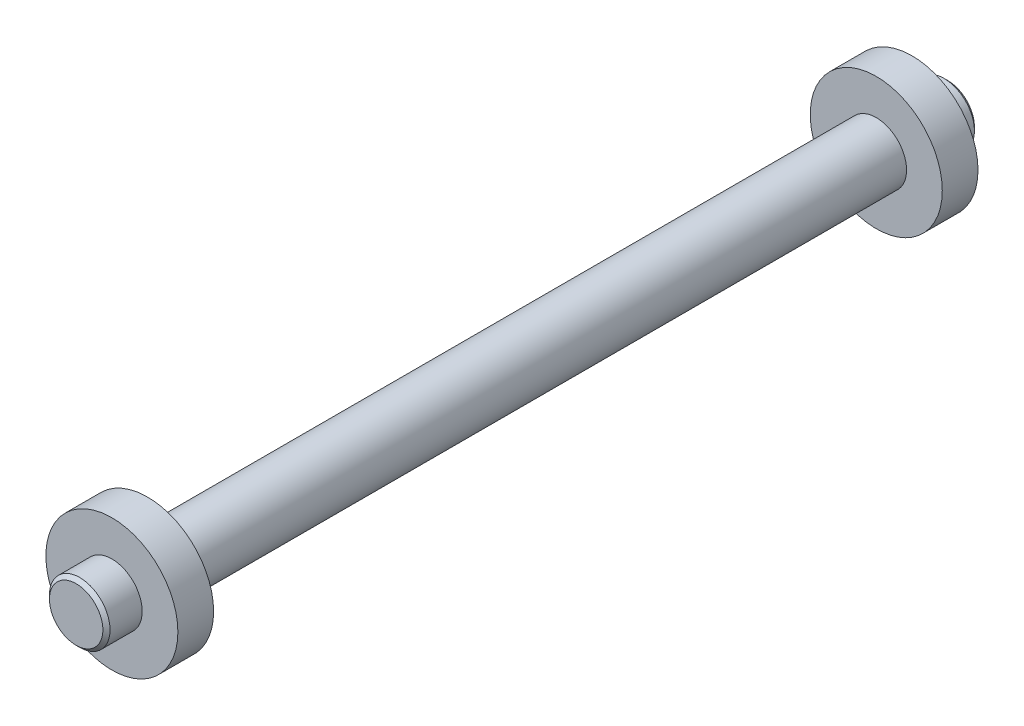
from build123d import *

# Parameters (mm, degrees)
CHAMFER_1_SIZE = 0.125


with BuildPart() as part:
    # Sketch 2 → Revolve 1 (revolve)
    with BuildSketch(Plane(origin=(0, 0, 0), x_dir=(0, 0, -1), z_dir=(1, 0, 0)), mode=Mode.PRIVATE) as revolve_1_sk:
        Polygon((-15.25, 0), (15.25, 0), (15.25, 1.06), (14, 1.06), (14, 2.31), (12.75, 2.31), (12.75, 1.06), (-12.75, 1.06), (-12.75, 2.31), (-14, 2.31), (-14, 1.06), (-15.25, 1.06), align=None)
    revolve(revolve_1_sk.sketch.rotate(Axis((0, 0, 15.25), (0, 0, -1)), 90), axis=Axis((0, 0, 15.25), (0, 0, -1)))

    # Chamfer 1
    chamfer_1_edges = [part.edges().sort_by_distance(p)[0] for p in [
        (-1.06, 0, -15.25),
        (-1.06, 0, 15.25),
    ]]
    chamfer(chamfer_1_edges, length=CHAMFER_1_SIZE)


solid = part.part
